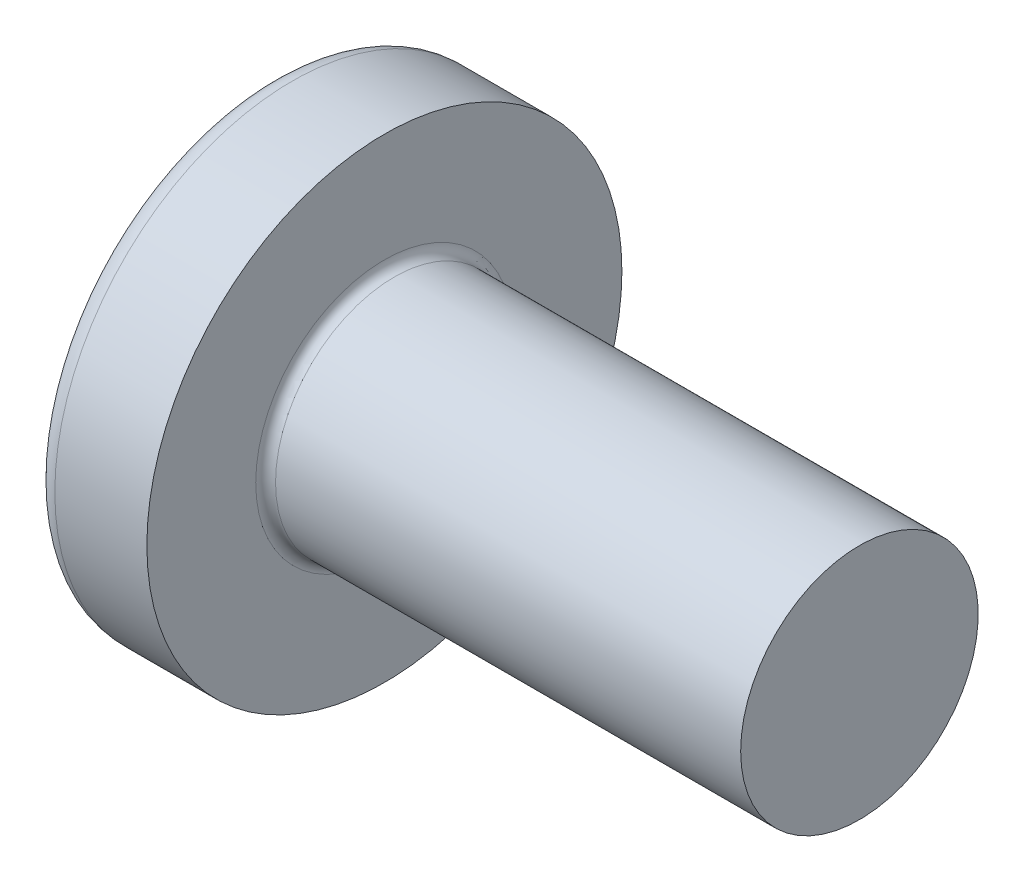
ISO-10303-21;
HEADER;
FILE_DESCRIPTION(('STEP AP214'),'2;1');
FILE_NAME('part.step','',(''),(''),'','','');
FILE_SCHEMA(('AUTOMOTIVE_DESIGN { 1 0 10303 214 1 1 1 1 }'));
ENDSEC;
DATA;
#1=APPLICATION_CONTEXT('core data for automotive mechanical design processes');
#2=APPLICATION_PROTOCOL_DEFINITION('international standard','automotive_design',2000,#1);
#3=PRODUCT_CONTEXT('',#1,'mechanical');
#4=PRODUCT('Part','Part','',(#3));
#5=PRODUCT_RELATED_PRODUCT_CATEGORY('part','',(#4));
#6=PRODUCT_DEFINITION_FORMATION('','',#4);
#7=PRODUCT_DEFINITION_CONTEXT('part definition',#1,'design');
#8=PRODUCT_DEFINITION('design','',#6,#7);
#9=PRODUCT_DEFINITION_SHAPE('','',#8);
#10=(LENGTH_UNIT() NAMED_UNIT(*) SI_UNIT(.MILLI.,.METRE.));
#11=(NAMED_UNIT(*) PLANE_ANGLE_UNIT() SI_UNIT($,.RADIAN.));
#12=(NAMED_UNIT(*) SI_UNIT($,.STERADIAN.) SOLID_ANGLE_UNIT());
#13=UNCERTAINTY_MEASURE_WITH_UNIT(LENGTH_MEASURE(1.E-05),#10,'distance_accuracy_value','');
#14=(GEOMETRIC_REPRESENTATION_CONTEXT(3) GLOBAL_UNCERTAINTY_ASSIGNED_CONTEXT((#13)) GLOBAL_UNIT_ASSIGNED_CONTEXT((#10,
#11,#12)) REPRESENTATION_CONTEXT('',''));
#15=CARTESIAN_POINT('',(0.,0.,0.));
#16=DIRECTION('',(0.,0.,1.));
#17=DIRECTION('',(1.,0.,0.));
#18=AXIS2_PLACEMENT_3D('',#15,#16,#17);
#19=CARTESIAN_POINT('',(10.,0.,0.));
#20=DIRECTION('',(-1.,0.,0.));
#21=DIRECTION('',(0.,1.,0.));
#22=AXIS2_PLACEMENT_3D('',#19,#20,#21);
#23=SPHERICAL_SURFACE('',#22,10.);
#24=CARTESIAN_POINT('',(1.83373872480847,0.,0.));
#25=DIRECTION('',(-1.,0.,0.));
#26=DIRECTION('',(0.,0.,1.));
#27=AXIS2_PLACEMENT_3D('',#24,#25,#26);
#28=CIRCLE('',#27,5.77167019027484);
#29=CARTESIAN_POINT('',(1.83373872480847,0.,5.77167019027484));
#30=VERTEX_POINT('',#29);
#31=EDGE_CURVE('E216',#30,#30,#28,.T.);
#32=ORIENTED_EDGE('',*,*,#31,.T.);
#33=EDGE_LOOP('',(#32));
#34=FACE_BOUND('',#33,.T.);
#35=CARTESIAN_POINT('',(0.11533271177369,0.,0.));
#36=DIRECTION('',(1.,0.,0.));
#37=DIRECTION('',(0.,0.,-1.));
#38=AXIS2_PLACEMENT_3D('',#35,#36,#37);
#39=CIRCLE('',#38,1.51438192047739);
#40=CARTESIAN_POINT('',(0.115332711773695,-0.709999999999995,-1.33762947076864));
#41=VERTEX_POINT('',#40);
#42=CARTESIAN_POINT('',(0.11533271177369,-1.33762947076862,-0.71));
#43=VERTEX_POINT('',#42);
#44=EDGE_CURVE('E343',#41,#43,#39,.F.);
#45=ORIENTED_EDGE('',*,*,#44,.F.);
#46=CARTESIAN_POINT('',(10.,-0.71,0.));
#47=DIRECTION('',(0.,1.,0.));
#48=DIRECTION('',(0.,0.,1.));
#49=AXIS2_PLACEMENT_3D('',#46,#47,#48);
#50=CIRCLE('',#49,9.97476315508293);
#51=CARTESIAN_POINT('',(0.516695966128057,-0.709999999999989,-3.09238493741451));
#52=VERTEX_POINT('',#51);
#53=EDGE_CURVE('E276',#52,#41,#50,.T.);
#54=ORIENTED_EDGE('',*,*,#53,.F.);
#55=CARTESIAN_POINT('',(9.3467899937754,0.,1.3101368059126));
#56=DIRECTION('',(0.446197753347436,0.,-0.894934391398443));
#57=DIRECTION('',(-0.894934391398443,0.,-0.446197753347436));
#58=AXIS2_PLACEMENT_3D('',#55,#56,#57);
#59=CIRCLE('',#58,9.89226254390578);
#60=CARTESIAN_POINT('',(0.516695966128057,0.710000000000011,-3.0923849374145));
#61=VERTEX_POINT('',#60);
#62=EDGE_CURVE('E250',#52,#61,#59,.T.);
#63=ORIENTED_EDGE('',*,*,#62,.T.);
#64=CARTESIAN_POINT('',(10.,0.71,0.));
#65=DIRECTION('',(0.,-1.,0.));
#66=DIRECTION('',(0.,0.,-1.));
#67=AXIS2_PLACEMENT_3D('',#64,#65,#66);
#68=CIRCLE('',#67,9.97476315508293);
#69=CARTESIAN_POINT('',(0.115332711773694,0.710000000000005,-1.33762947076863));
#70=VERTEX_POINT('',#69);
#71=EDGE_CURVE('E305',#70,#61,#68,.T.);
#72=ORIENTED_EDGE('',*,*,#71,.F.);
#73=CARTESIAN_POINT('',(0.11533271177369,1.33762947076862,-0.71));
#74=VERTEX_POINT('',#73);
#75=EDGE_CURVE('E358',#74,#70,#39,.F.);
#76=ORIENTED_EDGE('',*,*,#75,.F.);
#77=CARTESIAN_POINT('',(10.,0.,-0.71));
#78=DIRECTION('',(0.,0.,1.));
#79=DIRECTION('',(1.,0.,0.));
#80=AXIS2_PLACEMENT_3D('',#77,#78,#79);
#81=CIRCLE('',#80,9.97476315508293);
#82=CARTESIAN_POINT('',(0.516695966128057,3.09238493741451,-0.71));
#83=VERTEX_POINT('',#82);
#84=EDGE_CURVE('E244',#83,#74,#81,.T.);
#85=ORIENTED_EDGE('',*,*,#84,.F.);
#86=CARTESIAN_POINT('',(9.3467899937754,-1.3101368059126,0.));
#87=DIRECTION('',(0.446197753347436,0.894934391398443,0.));
#88=DIRECTION('',(-0.894934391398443,0.446197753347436,0.));
#89=AXIS2_PLACEMENT_3D('',#86,#87,#88);
#90=CIRCLE('',#89,9.89226254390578);
#91=CARTESIAN_POINT('',(0.516695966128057,3.09238493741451,0.71));
#92=VERTEX_POINT('',#91);
#93=EDGE_CURVE('E247',#83,#92,#90,.T.);
#94=ORIENTED_EDGE('',*,*,#93,.T.);
#95=CARTESIAN_POINT('',(10.,0.,0.71));
#96=DIRECTION('',(0.,0.,-1.));
#97=DIRECTION('',(0.,1.,0.));
#98=AXIS2_PLACEMENT_3D('',#95,#96,#97);
#99=CIRCLE('',#98,9.97476315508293);
#100=CARTESIAN_POINT('',(0.11533271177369,1.33762947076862,0.71));
#101=VERTEX_POINT('',#100);
#102=EDGE_CURVE('E240',#101,#92,#99,.T.);
#103=ORIENTED_EDGE('',*,*,#102,.F.);
#104=CARTESIAN_POINT('',(0.115332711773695,0.709999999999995,1.33762947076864));
#105=VERTEX_POINT('',#104);
#106=EDGE_CURVE('E357',#105,#101,#39,.F.);
#107=ORIENTED_EDGE('',*,*,#106,.F.);
#108=CARTESIAN_POINT('',(0.516695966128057,0.709999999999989,3.09238493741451));
#109=VERTEX_POINT('',#108);
#110=EDGE_CURVE('E260',#109,#105,#68,.T.);
#111=ORIENTED_EDGE('',*,*,#110,.F.);
#112=CARTESIAN_POINT('',(9.3467899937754,0.,-1.3101368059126));
#113=DIRECTION('',(0.446197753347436,0.,0.894934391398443));
#114=DIRECTION('',(0.894934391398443,0.,-0.446197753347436));
#115=AXIS2_PLACEMENT_3D('',#112,#113,#114);
#116=CIRCLE('',#115,9.89226254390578);
#117=CARTESIAN_POINT('',(0.516695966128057,-0.710000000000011,3.0923849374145));
#118=VERTEX_POINT('',#117);
#119=EDGE_CURVE('E51',#109,#118,#116,.T.);
#120=ORIENTED_EDGE('',*,*,#119,.T.);
#121=CARTESIAN_POINT('',(0.115332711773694,-0.710000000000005,1.33762947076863));
#122=VERTEX_POINT('',#121);
#123=EDGE_CURVE('E257',#122,#118,#50,.T.);
#124=ORIENTED_EDGE('',*,*,#123,.F.);
#125=CARTESIAN_POINT('',(0.11533271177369,-1.33762947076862,0.709999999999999));
#126=VERTEX_POINT('',#125);
#127=EDGE_CURVE('E393',#126,#122,#39,.F.);
#128=ORIENTED_EDGE('',*,*,#127,.F.);
#129=CARTESIAN_POINT('',(0.516695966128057,-3.0923849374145,0.709999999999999));
#130=VERTEX_POINT('',#129);
#131=EDGE_CURVE('E241',#130,#126,#99,.T.);
#132=ORIENTED_EDGE('',*,*,#131,.F.);
#133=CARTESIAN_POINT('',(9.3467899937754,1.3101368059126,0.));
#134=DIRECTION('',(0.446197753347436,-0.894934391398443,0.));
#135=DIRECTION('',(0.894934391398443,0.446197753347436,0.));
#136=AXIS2_PLACEMENT_3D('',#133,#134,#135);
#137=CIRCLE('',#136,9.89226254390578);
#138=CARTESIAN_POINT('',(0.516695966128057,-3.09238493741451,-0.71));
#139=VERTEX_POINT('',#138);
#140=EDGE_CURVE('E237',#130,#139,#137,.T.);
#141=ORIENTED_EDGE('',*,*,#140,.T.);
#142=EDGE_CURVE('E66',#43,#139,#81,.T.);
#143=ORIENTED_EDGE('',*,*,#142,.F.);
#144=EDGE_LOOP('',(#45,#54,#63,#72,#76,#85,#94,#103,#107,#111,#120,#124,#128,#132,#141,#143));
#145=FACE_BOUND('',#144,.T.);
#146=ADVANCED_FACE('F37',(#34,#145),#23,.T.);
#147=CARTESIAN_POINT('',(3.46,1.62490792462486,-0.71));
#148=DIRECTION('',(0.,0.,1.));
#149=DIRECTION('',(1.,0.,0.));
#150=AXIS2_PLACEMENT_3D('',#147,#148,#149);
#151=PLANE('',#150);
#152=ORIENTED_EDGE('',*,*,#84,.T.);
#153=CARTESIAN_POINT('',(-2.28089704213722,1.52473965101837,-0.71));
#154=CARTESIAN_POINT('',(-1.81861622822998,1.48907386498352,-0.71));
#155=CARTESIAN_POINT('',(-1.35635131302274,1.45320000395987,-0.71));
#156=CARTESIAN_POINT('',(-0.431857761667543,1.3808964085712,-0.71));
#157=CARTESIAN_POINT('',(0.0303708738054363,1.34446666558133,-0.71));
#158=CARTESIAN_POINT('',(0.954772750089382,1.27091270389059,-0.71));
#159=CARTESIAN_POINT('',(1.41694599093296,1.23378848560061,-0.71));
#160=CARTESIAN_POINT('',(2.1101468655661,1.17741958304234,-0.71));
#161=CARTESIAN_POINT('',(2.34120225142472,1.15851633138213,-0.71));
#162=CARTESIAN_POINT('',(2.80329254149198,1.12044387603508,-0.71));
#163=CARTESIAN_POINT('',(3.03432744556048,1.10127467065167,-0.71));
#164=CARTESIAN_POINT('',(3.81376951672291,1.03608826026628,-0.71));
#165=CARTESIAN_POINT('',(4.3621185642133,0.989367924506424,-0.71));
#166=CARTESIAN_POINT('',(5.18446393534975,0.917336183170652,-0.71));
#167=CARTESIAN_POINT('',(5.45854573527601,0.893000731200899,-0.71));
#168=CARTESIAN_POINT('',(6.00663594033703,0.843493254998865,-0.71));
#169=CARTESIAN_POINT('',(6.28064434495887,0.818321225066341,-0.71));
#170=CARTESIAN_POINT('',(6.82859287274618,0.766879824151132,-0.71));
#171=CARTESIAN_POINT('',(7.10253298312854,0.740610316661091,-0.71));
#172=CARTESIAN_POINT('',(7.65026285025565,0.686585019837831,-0.71));
#173=CARTESIAN_POINT('',(7.92405260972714,0.658829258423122,-0.71));
#174=CARTESIAN_POINT('',(8.33458184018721,0.615573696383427,-0.71));
#175=CARTESIAN_POINT('',(8.4714065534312,0.600884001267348,-0.71));
#176=CARTESIAN_POINT('',(8.74498055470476,0.570826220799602,-0.71));
#177=CARTESIAN_POINT('',(8.88172984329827,0.555458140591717,-0.71));
#178=CARTESIAN_POINT('',(9.15513948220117,0.523868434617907,-0.71));
#179=CARTESIAN_POINT('',(9.29179982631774,0.507646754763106,-0.71));
#180=CARTESIAN_POINT('',(9.56498051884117,0.474039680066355,-0.71));
#181=CARTESIAN_POINT('',(9.70150086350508,0.45665425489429,-0.71));
#182=CARTESIAN_POINT('',(9.83792645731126,0.438531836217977,-0.71));
#183=B_SPLINE_CURVE_WITH_KNOTS('',3,(#153,#154,#155,#156,#157,#158,#159,#160,#161,#162,#163,
#164,#165,#166,#167,#168,#169,#170,#171,#172,#173,#174,#175,#176,#177,#178,#179,#180,#181,#182),
.UNSPECIFIED.,.F.,.F.,(4,2,2,2,2,2,2,2,2,2,2,2,2,2,4),(0.,1.39096401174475,2.78194962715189,
4.17293441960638,4.86841633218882,5.56390268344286,7.21490482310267,8.04038405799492,
8.86586891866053,9.69145676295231,10.5170291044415,10.9298607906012,11.3426893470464,
11.7555440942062,12.1684096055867),.UNSPECIFIED.);
#184=CARTESIAN_POINT('',(3.46,1.06563607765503,-0.710000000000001));
#185=VERTEX_POINT('',#184);
#186=EDGE_CURVE('E380',#74,#185,#183,.T.);
#187=ORIENTED_EDGE('',*,*,#186,.T.);
#188=DIRECTION('',(0.,1.,0.));
#189=VECTOR('',#188,1.);
#190=CARTESIAN_POINT('',(3.46,-1.62490792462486,-0.71));
#191=LINE('',#190,#189);
#192=CARTESIAN_POINT('',(3.46,1.62490792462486,-0.71));
#193=VERTEX_POINT('',#192);
#194=EDGE_CURVE('E326',#185,#193,#191,.T.);
#195=ORIENTED_EDGE('',*,*,#194,.T.);
#196=DIRECTION('',(0.894934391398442,-0.446197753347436,0.));
#197=VECTOR('',#196,1.);
#198=CARTESIAN_POINT('',(0.,3.35,-0.71));
#199=LINE('',#198,#197);
#200=EDGE_CURVE('E217',#83,#193,#199,.T.);
#201=ORIENTED_EDGE('',*,*,#200,.F.);
#202=EDGE_LOOP('',(#152,#187,#195,#201));
#203=FACE_BOUND('',#202,.T.);
#204=ADVANCED_FACE('F172',(#203),#151,.T.);
#205=CARTESIAN_POINT('',(3.46,-1.62490792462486,-0.71));
#206=VERTEX_POINT('',#205);
#207=CARTESIAN_POINT('',(3.46,-1.06563607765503,-0.710000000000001));
#208=VERTEX_POINT('',#207);
#209=EDGE_CURVE('E225',#206,#208,#191,.T.);
#210=ORIENTED_EDGE('',*,*,#209,.T.);
#211=CARTESIAN_POINT('',(-2.28089704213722,-1.52473965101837,-0.71));
#212=CARTESIAN_POINT('',(-1.81861622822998,-1.48907386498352,-0.71));
#213=CARTESIAN_POINT('',(-1.35635131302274,-1.45320000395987,-0.71));
#214=CARTESIAN_POINT('',(-0.431857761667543,-1.3808964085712,-0.71));
#215=CARTESIAN_POINT('',(0.0303708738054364,-1.34446666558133,-0.71));
#216=CARTESIAN_POINT('',(0.954772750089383,-1.27091270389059,-0.71));
#217=CARTESIAN_POINT('',(1.41694599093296,-1.23378848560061,-0.71));
#218=CARTESIAN_POINT('',(2.1101468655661,-1.17741958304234,-0.71));
#219=CARTESIAN_POINT('',(2.34120225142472,-1.15851633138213,-0.71));
#220=CARTESIAN_POINT('',(2.80329254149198,-1.12044387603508,-0.71));
#221=CARTESIAN_POINT('',(3.03432744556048,-1.10127467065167,-0.71));
#222=CARTESIAN_POINT('',(3.81376951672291,-1.03608826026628,-0.71));
#223=CARTESIAN_POINT('',(4.3621185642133,-0.989367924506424,-0.71));
#224=CARTESIAN_POINT('',(5.18446393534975,-0.917336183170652,-0.71));
#225=CARTESIAN_POINT('',(5.45854573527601,-0.893000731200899,-0.71));
#226=CARTESIAN_POINT('',(6.00663594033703,-0.843493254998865,-0.71));
#227=CARTESIAN_POINT('',(6.28064434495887,-0.818321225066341,-0.71));
#228=CARTESIAN_POINT('',(6.82859287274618,-0.766879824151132,-0.71));
#229=CARTESIAN_POINT('',(7.10253298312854,-0.740610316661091,-0.71));
#230=CARTESIAN_POINT('',(7.65026285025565,-0.686585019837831,-0.71));
#231=CARTESIAN_POINT('',(7.92405260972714,-0.658829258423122,-0.71));
#232=CARTESIAN_POINT('',(8.33458184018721,-0.615573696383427,-0.71));
#233=CARTESIAN_POINT('',(8.4714065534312,-0.600884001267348,-0.71));
#234=CARTESIAN_POINT('',(8.74498055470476,-0.570826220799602,-0.71));
#235=CARTESIAN_POINT('',(8.88172984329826,-0.555458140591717,-0.71));
#236=CARTESIAN_POINT('',(9.15513948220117,-0.523868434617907,-0.71));
#237=CARTESIAN_POINT('',(9.29179982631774,-0.507646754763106,-0.71));
#238=CARTESIAN_POINT('',(9.56498051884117,-0.474039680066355,-0.71));
#239=CARTESIAN_POINT('',(9.70150086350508,-0.456654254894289,-0.71));
#240=CARTESIAN_POINT('',(9.83792645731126,-0.438531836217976,-0.71));
#241=B_SPLINE_CURVE_WITH_KNOTS('',3,(#211,#212,#213,#214,#215,#216,#217,#218,#219,#220,#221,
#222,#223,#224,#225,#226,#227,#228,#229,#230,#231,#232,#233,#234,#235,#236,#237,#238,#239,#240),
.UNSPECIFIED.,.F.,.F.,(4,2,2,2,2,2,2,2,2,2,2,2,2,2,4),(0.,1.39096401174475,2.78194962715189,
4.17293441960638,4.86841633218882,5.56390268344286,7.21490482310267,8.04038405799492,
8.86586891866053,9.69145676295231,10.5170291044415,10.9298607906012,11.3426893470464,
11.7555440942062,12.1684096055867),.UNSPECIFIED.);
#242=EDGE_CURVE('E356',#208,#43,#241,.F.);
#243=ORIENTED_EDGE('',*,*,#242,.T.);
#244=ORIENTED_EDGE('',*,*,#142,.T.);
#245=DIRECTION('',(0.894934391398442,0.446197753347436,0.));
#246=VECTOR('',#245,1.);
#247=CARTESIAN_POINT('',(0.,-3.35,-0.71));
#248=LINE('',#247,#246);
#249=EDGE_CURVE('E308',#139,#206,#248,.T.);
#250=ORIENTED_EDGE('',*,*,#249,.T.);
#251=EDGE_LOOP('',(#210,#243,#244,#250));
#252=FACE_BOUND('',#251,.T.);
#253=ADVANCED_FACE('F178',(#252),#151,.T.);
#254=CARTESIAN_POINT('',(3.46,-1.62490792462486,0.71));
#255=DIRECTION('',(0.,0.,-1.));
#256=DIRECTION('',(0.,1.,0.));
#257=AXIS2_PLACEMENT_3D('',#254,#255,#256);
#258=PLANE('',#257);
#259=DIRECTION('',(0.,-1.,0.));
#260=VECTOR('',#259,1.);
#261=CARTESIAN_POINT('',(3.46,1.62490792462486,0.71));
#262=LINE('',#261,#260);
#263=CARTESIAN_POINT('',(3.46,1.62490792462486,0.71));
#264=VERTEX_POINT('',#263);
#265=CARTESIAN_POINT('',(3.46,1.06563607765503,0.710000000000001));
#266=VERTEX_POINT('',#265);
#267=EDGE_CURVE('E316',#264,#266,#262,.T.);
#268=ORIENTED_EDGE('',*,*,#267,.T.);
#269=CARTESIAN_POINT('',(-2.28089705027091,1.52473965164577,0.71));
#270=CARTESIAN_POINT('',(-1.81861623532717,1.48907386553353,0.71));
#271=CARTESIAN_POINT('',(-1.35635131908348,1.45320000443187,0.71));
#272=CARTESIAN_POINT('',(-0.431857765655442,1.38089640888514,0.71));
#273=CARTESIAN_POINT('',(0.0303708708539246,1.3444666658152,0.71));
#274=CARTESIAN_POINT('',(0.954772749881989,1.27091270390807,0.71));
#275=CARTESIAN_POINT('',(1.41694599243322,1.23378848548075,0.71));
#276=CARTESIAN_POINT('',(2.11014686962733,1.17741958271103,0.71));
#277=CARTESIAN_POINT('',(2.3412022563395,1.15851633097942,0.71));
#278=CARTESIAN_POINT('',(2.80329254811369,1.12044387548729,0.71));
#279=CARTESIAN_POINT('',(3.03432745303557,1.10127467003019,0.71));
#280=CARTESIAN_POINT('',(3.8137695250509,1.03608825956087,0.71));
#281=CARTESIAN_POINT('',(4.36211857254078,0.989367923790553,0.71));
#282=CARTESIAN_POINT('',(5.18446394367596,0.917336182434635,0.71));
#283=CARTESIAN_POINT('',(5.45854574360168,0.893000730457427,0.71));
#284=CARTESIAN_POINT('',(6.00663594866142,0.843493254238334,0.71));
#285=CARTESIAN_POINT('',(6.28064435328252,0.818321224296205,0.71));
#286=CARTESIAN_POINT('',(6.82859288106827,0.766879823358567,0.71));
#287=CARTESIAN_POINT('',(7.1025329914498,0.7406103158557,0.71));
#288=CARTESIAN_POINT('',(7.65026285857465,0.686585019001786,0.71));
#289=CARTESIAN_POINT('',(7.92405261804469,0.658829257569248,0.71));
#290=CARTESIAN_POINT('',(8.3345818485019,0.61557369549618,0.71));
#291=CARTESIAN_POINT('',(8.47140656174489,0.600884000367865,0.71));
#292=CARTESIAN_POINT('',(8.74498056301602,0.570826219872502,0.71));
#293=CARTESIAN_POINT('',(8.8817298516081,0.555458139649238,0.71));
#294=CARTESIAN_POINT('',(9.15513949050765,0.523868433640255,0.71));
#295=CARTESIAN_POINT('',(9.29179983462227,0.50764675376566,0.71));
#296=CARTESIAN_POINT('',(9.56498052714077,0.474039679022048,0.71));
#297=CARTESIAN_POINT('',(9.70150087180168,0.456654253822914,0.71));
#298=CARTESIAN_POINT('',(9.83792646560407,0.438531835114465,0.71));
#299=B_SPLINE_CURVE_WITH_KNOTS('',3,(#269,#270,#271,#272,#273,#274,#275,#276,#277,#278,#279,
#280,#281,#282,#283,#284,#285,#286,#287,#288,#289,#290,#291,#292,#293,#294,#295,#296,#297,#298),
.UNSPECIFIED.,.F.,.F.,(4,2,2,2,2,2,2,2,2,2,2,2,2,2,4),(0.,1.39096401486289,2.78194963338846,
4.17293443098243,4.86841634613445,5.56390269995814,7.21490483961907,8.04038407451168,
8.86586893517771,9.69145677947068,10.5170291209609,10.9298608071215,11.3426893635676,
11.7555441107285,12.1684096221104),.UNSPECIFIED.);
#300=EDGE_CURVE('E281',#266,#101,#299,.F.);
#301=ORIENTED_EDGE('',*,*,#300,.T.);
#302=ORIENTED_EDGE('',*,*,#102,.T.);
#303=DIRECTION('',(0.894934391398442,-0.446197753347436,0.));
#304=VECTOR('',#303,1.);
#305=CARTESIAN_POINT('',(0.,3.35,0.71));
#306=LINE('',#305,#304);
#307=EDGE_CURVE('E222',#92,#264,#306,.T.);
#308=ORIENTED_EDGE('',*,*,#307,.T.);
#309=EDGE_LOOP('',(#268,#301,#302,#308));
#310=FACE_BOUND('',#309,.T.);
#311=ADVANCED_FACE('F376',(#310),#258,.T.);
#312=ORIENTED_EDGE('',*,*,#131,.T.);
#313=CARTESIAN_POINT('',(-2.28089704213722,-1.52473965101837,0.71));
#314=CARTESIAN_POINT('',(-1.81861622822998,-1.48907386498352,0.71));
#315=CARTESIAN_POINT('',(-1.35635131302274,-1.45320000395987,0.71));
#316=CARTESIAN_POINT('',(-0.431857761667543,-1.3808964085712,0.71));
#317=CARTESIAN_POINT('',(0.0303708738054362,-1.34446666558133,0.71));
#318=CARTESIAN_POINT('',(0.954772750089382,-1.27091270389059,0.71));
#319=CARTESIAN_POINT('',(1.41694599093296,-1.23378848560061,0.71));
#320=CARTESIAN_POINT('',(2.1101468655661,-1.17741958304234,0.71));
#321=CARTESIAN_POINT('',(2.34120225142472,-1.15851633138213,0.71));
#322=CARTESIAN_POINT('',(2.80329254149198,-1.12044387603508,0.71));
#323=CARTESIAN_POINT('',(3.03432744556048,-1.10127467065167,0.71));
#324=CARTESIAN_POINT('',(3.81376951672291,-1.03608826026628,0.71));
#325=CARTESIAN_POINT('',(4.3621185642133,-0.989367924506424,0.71));
#326=CARTESIAN_POINT('',(5.18446393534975,-0.917336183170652,0.71));
#327=CARTESIAN_POINT('',(5.45854573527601,-0.893000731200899,0.71));
#328=CARTESIAN_POINT('',(6.00663594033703,-0.843493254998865,0.71));
#329=CARTESIAN_POINT('',(6.28064434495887,-0.818321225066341,0.71));
#330=CARTESIAN_POINT('',(6.82859287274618,-0.766879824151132,0.71));
#331=CARTESIAN_POINT('',(7.10253298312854,-0.740610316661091,0.71));
#332=CARTESIAN_POINT('',(7.65026285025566,-0.686585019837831,0.71));
#333=CARTESIAN_POINT('',(7.92405260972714,-0.658829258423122,0.71));
#334=CARTESIAN_POINT('',(8.33458184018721,-0.615573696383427,0.71));
#335=CARTESIAN_POINT('',(8.4714065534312,-0.600884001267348,0.71));
#336=CARTESIAN_POINT('',(8.74498055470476,-0.570826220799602,0.71));
#337=CARTESIAN_POINT('',(8.88172984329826,-0.555458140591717,0.71));
#338=CARTESIAN_POINT('',(9.15513948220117,-0.523868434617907,0.71));
#339=CARTESIAN_POINT('',(9.29179982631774,-0.507646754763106,0.71));
#340=CARTESIAN_POINT('',(9.56498051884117,-0.474039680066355,0.71));
#341=CARTESIAN_POINT('',(9.70150086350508,-0.456654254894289,0.71));
#342=CARTESIAN_POINT('',(9.83792645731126,-0.438531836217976,0.71));
#343=B_SPLINE_CURVE_WITH_KNOTS('',3,(#313,#314,#315,#316,#317,#318,#319,#320,#321,#322,#323,
#324,#325,#326,#327,#328,#329,#330,#331,#332,#333,#334,#335,#336,#337,#338,#339,#340,#341,#342),
.UNSPECIFIED.,.F.,.F.,(4,2,2,2,2,2,2,2,2,2,2,2,2,2,4),(0.,1.39096401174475,2.78194962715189,
4.17293441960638,4.86841633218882,5.56390268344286,7.21490482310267,8.04038405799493,
8.86586891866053,9.69145676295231,10.5170291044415,10.9298607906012,11.3426893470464,
11.7555440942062,12.1684096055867),.UNSPECIFIED.);
#344=CARTESIAN_POINT('',(3.46,-1.06563607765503,0.710000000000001));
#345=VERTEX_POINT('',#344);
#346=EDGE_CURVE('E394',#126,#345,#343,.T.);
#347=ORIENTED_EDGE('',*,*,#346,.T.);
#348=CARTESIAN_POINT('',(3.46,-1.62490792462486,0.71));
#349=VERTEX_POINT('',#348);
#350=EDGE_CURVE('E318',#345,#349,#262,.T.);
#351=ORIENTED_EDGE('',*,*,#350,.T.);
#352=DIRECTION('',(0.894934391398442,0.446197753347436,0.));
#353=VECTOR('',#352,1.);
#354=CARTESIAN_POINT('',(0.,-3.35,0.709999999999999));
#355=LINE('',#354,#353);
#356=EDGE_CURVE('E310',#130,#349,#355,.T.);
#357=ORIENTED_EDGE('',*,*,#356,.F.);
#358=EDGE_LOOP('',(#312,#347,#351,#357));
#359=FACE_BOUND('',#358,.T.);
#360=ADVANCED_FACE('F424',(#359),#258,.T.);
#361=CARTESIAN_POINT('',(3.46,1.62490792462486,-0.709999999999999));
#362=DIRECTION('',(-1.,0.,0.));
#363=DIRECTION('',(0.,0.,1.));
#364=AXIS2_PLACEMENT_3D('',#361,#362,#363);
#365=PLANE('',#364);
#366=ORIENTED_EDGE('',*,*,#350,.F.);
#367=CARTESIAN_POINT('',(3.46,0.,0.));
#368=DIRECTION('',(-1.,0.,0.));
#369=DIRECTION('',(0.,0.,1.));
#370=AXIS2_PLACEMENT_3D('',#367,#368,#369);
#371=CIRCLE('',#370,1.2805);
#372=EDGE_CURVE('E351',#208,#345,#371,.T.);
#373=ORIENTED_EDGE('',*,*,#372,.F.);
#374=ORIENTED_EDGE('',*,*,#209,.F.);
#375=DIRECTION('',(0.,0.,1.));
#376=VECTOR('',#375,1.);
#377=CARTESIAN_POINT('',(3.46,-1.62490792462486,-0.71));
#378=LINE('',#377,#376);
#379=EDGE_CURVE('E313',#206,#349,#378,.T.);
#380=ORIENTED_EDGE('',*,*,#379,.T.);
#381=EDGE_LOOP('',(#366,#373,#374,#380));
#382=FACE_BOUND('',#381,.T.);
#383=ADVANCED_FACE('F417',(#382),#365,.T.);
#384=DIRECTION('',(0.,0.,-1.));
#385=VECTOR('',#384,1.);
#386=CARTESIAN_POINT('',(3.46,-0.710000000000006,1.62490792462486));
#387=LINE('',#386,#385);
#388=CARTESIAN_POINT('',(3.46,-0.709999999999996,-1.06563607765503));
#389=VERTEX_POINT('',#388);
#390=CARTESIAN_POINT('',(3.46,-0.709999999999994,-1.62490792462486));
#391=VERTEX_POINT('',#390);
#392=EDGE_CURVE('E299',#389,#391,#387,.T.);
#393=ORIENTED_EDGE('',*,*,#392,.F.);
#394=CARTESIAN_POINT('',(3.46,0.710000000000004,-1.06563607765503));
#395=VERTEX_POINT('',#394);
#396=EDGE_CURVE('E58',#395,#389,#371,.T.);
#397=ORIENTED_EDGE('',*,*,#396,.F.);
#398=DIRECTION('',(0.,0.,1.));
#399=VECTOR('',#398,1.);
#400=CARTESIAN_POINT('',(3.46,0.710000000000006,-1.62490792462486));
#401=LINE('',#400,#399);
#402=CARTESIAN_POINT('',(3.46,0.710000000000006,-1.62490792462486));
#403=VERTEX_POINT('',#402);
#404=EDGE_CURVE('E302',#403,#395,#401,.T.);
#405=ORIENTED_EDGE('',*,*,#404,.F.);
#406=DIRECTION('',(0.,-1.,0.));
#407=VECTOR('',#406,1.);
#408=CARTESIAN_POINT('',(3.46,0.710000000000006,-1.62490792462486));
#409=LINE('',#408,#407);
#410=EDGE_CURVE('E293',#403,#391,#409,.T.);
#411=ORIENTED_EDGE('',*,*,#410,.T.);
#412=EDGE_LOOP('',(#393,#397,#405,#411));
#413=FACE_BOUND('',#412,.T.);
#414=ADVANCED_FACE('F346',(#413),#365,.T.);
#415=ORIENTED_EDGE('',*,*,#194,.F.);
#416=EDGE_CURVE('E350',#266,#185,#371,.T.);
#417=ORIENTED_EDGE('',*,*,#416,.F.);
#418=ORIENTED_EDGE('',*,*,#267,.F.);
#419=DIRECTION('',(0.,0.,-1.));
#420=VECTOR('',#419,1.);
#421=CARTESIAN_POINT('',(3.46,1.62490792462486,0.71));
#422=LINE('',#421,#420);
#423=EDGE_CURVE('E319',#264,#193,#422,.T.);
#424=ORIENTED_EDGE('',*,*,#423,.T.);
#425=EDGE_LOOP('',(#415,#417,#418,#424));
#426=FACE_BOUND('',#425,.T.);
#427=ADVANCED_FACE('F418',(#426),#365,.T.);
#428=CARTESIAN_POINT('',(3.46,0.709999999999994,1.62490792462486));
#429=DIRECTION('',(0.,-1.,0.));
#430=DIRECTION('',(1.,0.,0.));
#431=AXIS2_PLACEMENT_3D('',#428,#429,#430);
#432=PLANE('',#431);
#433=ORIENTED_EDGE('',*,*,#110,.T.);
#434=CARTESIAN_POINT('',(-2.28089704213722,0.709999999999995,1.52473965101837));
#435=CARTESIAN_POINT('',(-1.81861622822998,0.709999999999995,1.48907386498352));
#436=CARTESIAN_POINT('',(-1.35635131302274,0.709999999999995,1.45320000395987));
#437=CARTESIAN_POINT('',(-0.431857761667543,0.709999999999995,1.38089640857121));
#438=CARTESIAN_POINT('',(0.0303708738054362,0.709999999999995,1.34446666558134));
#439=CARTESIAN_POINT('',(0.954772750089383,0.709999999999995,1.2709127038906));
#440=CARTESIAN_POINT('',(1.41694599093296,0.709999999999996,1.23378848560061));
#441=CARTESIAN_POINT('',(2.1101468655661,0.709999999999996,1.17741958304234));
#442=CARTESIAN_POINT('',(2.34120225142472,0.709999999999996,1.15851633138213));
#443=CARTESIAN_POINT('',(2.80329254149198,0.709999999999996,1.12044387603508));
#444=CARTESIAN_POINT('',(3.03432744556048,0.709999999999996,1.10127467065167));
#445=CARTESIAN_POINT('',(3.81376951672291,0.709999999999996,1.03608826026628));
#446=CARTESIAN_POINT('',(4.3621185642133,0.709999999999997,0.989367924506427));
#447=CARTESIAN_POINT('',(5.18446393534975,0.709999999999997,0.917336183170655));
#448=CARTESIAN_POINT('',(5.45854573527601,0.709999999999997,0.893000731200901));
#449=CARTESIAN_POINT('',(6.00663594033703,0.709999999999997,0.843493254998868));
#450=CARTESIAN_POINT('',(6.28064434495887,0.709999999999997,0.818321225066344));
#451=CARTESIAN_POINT('',(6.82859287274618,0.709999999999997,0.766879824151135));
#452=CARTESIAN_POINT('',(7.10253298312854,0.709999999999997,0.740610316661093));
#453=CARTESIAN_POINT('',(7.65026285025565,0.709999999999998,0.686585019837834));
#454=CARTESIAN_POINT('',(7.92405260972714,0.709999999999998,0.658829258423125));
#455=CARTESIAN_POINT('',(8.33458184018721,0.709999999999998,0.615573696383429));
#456=CARTESIAN_POINT('',(8.4714065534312,0.709999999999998,0.600884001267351));
#457=CARTESIAN_POINT('',(8.74498055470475,0.709999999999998,0.570826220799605));
#458=CARTESIAN_POINT('',(8.88172984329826,0.709999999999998,0.55545814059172));
#459=CARTESIAN_POINT('',(9.15513948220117,0.709999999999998,0.52386843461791));
#460=CARTESIAN_POINT('',(9.29179982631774,0.709999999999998,0.507646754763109));
#461=CARTESIAN_POINT('',(9.56498051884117,0.709999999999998,0.474039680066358));
#462=CARTESIAN_POINT('',(9.70150086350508,0.709999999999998,0.456654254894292));
#463=CARTESIAN_POINT('',(9.83792645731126,0.709999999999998,0.438531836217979));
#464=B_SPLINE_CURVE_WITH_KNOTS('',3,(#434,#435,#436,#437,#438,#439,#440,#441,#442,#443,#444,
#445,#446,#447,#448,#449,#450,#451,#452,#453,#454,#455,#456,#457,#458,#459,#460,#461,#462,#463),
.UNSPECIFIED.,.F.,.F.,(4,2,2,2,2,2,2,2,2,2,2,2,2,2,4),(0.,1.39096401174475,2.78194962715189,
4.17293441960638,4.86841633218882,5.56390268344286,7.21490482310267,8.04038405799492,
8.86586891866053,9.6914567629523,10.5170291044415,10.9298607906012,11.3426893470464,
11.7555440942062,12.1684096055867),.UNSPECIFIED.);
#465=CARTESIAN_POINT('',(3.46,0.709999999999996,1.06563607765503));
#466=VERTEX_POINT('',#465);
#467=EDGE_CURVE('E442',#105,#466,#464,.T.);
#468=ORIENTED_EDGE('',*,*,#467,.T.);
#469=CARTESIAN_POINT('',(3.46,0.709999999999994,1.62490792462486));
#470=VERTEX_POINT('',#469);
#471=EDGE_CURVE('E274',#466,#470,#401,.T.);
#472=ORIENTED_EDGE('',*,*,#471,.T.);
#473=DIRECTION('',(0.894934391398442,0.,-0.446197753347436));
#474=VECTOR('',#473,1.);
#475=CARTESIAN_POINT('',(0.,0.709999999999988,3.35));
#476=LINE('',#475,#474);
#477=EDGE_CURVE('E267',#109,#470,#476,.T.);
#478=ORIENTED_EDGE('',*,*,#477,.F.);
#479=EDGE_LOOP('',(#433,#468,#472,#478));
#480=FACE_BOUND('',#479,.T.);
#481=ADVANCED_FACE('F271',(#480),#432,.T.);
#482=CARTESIAN_POINT('',(3.46,-0.709999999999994,-1.62490792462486));
#483=DIRECTION('',(0.,1.,0.));
#484=DIRECTION('',(0.,0.,1.));
#485=AXIS2_PLACEMENT_3D('',#482,#483,#484);
#486=PLANE('',#485);
#487=CARTESIAN_POINT('',(3.46,-0.710000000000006,1.62490792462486));
#488=VERTEX_POINT('',#487);
#489=CARTESIAN_POINT('',(3.46,-0.710000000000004,1.06563607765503));
#490=VERTEX_POINT('',#489);
#491=EDGE_CURVE('E296',#488,#490,#387,.T.);
#492=ORIENTED_EDGE('',*,*,#491,.T.);
#493=CARTESIAN_POINT('',(-2.28089705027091,-0.710000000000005,1.52473965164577));
#494=CARTESIAN_POINT('',(-1.81861623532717,-0.710000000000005,1.48907386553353));
#495=CARTESIAN_POINT('',(-1.35635131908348,-0.710000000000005,1.45320000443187));
#496=CARTESIAN_POINT('',(-0.431857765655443,-0.710000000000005,1.38089640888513));
#497=CARTESIAN_POINT('',(0.030370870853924,-0.710000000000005,1.3444666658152));
#498=CARTESIAN_POINT('',(0.954772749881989,-0.710000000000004,1.27091270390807));
#499=CARTESIAN_POINT('',(1.41694599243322,-0.710000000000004,1.23378848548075));
#500=CARTESIAN_POINT('',(2.11014686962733,-0.710000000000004,1.17741958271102));
#501=CARTESIAN_POINT('',(2.3412022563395,-0.710000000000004,1.15851633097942));
#502=CARTESIAN_POINT('',(2.80329254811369,-0.710000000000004,1.12044387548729));
#503=CARTESIAN_POINT('',(3.03432745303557,-0.710000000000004,1.10127467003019));
#504=CARTESIAN_POINT('',(3.81376952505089,-0.710000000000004,1.03608825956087));
#505=CARTESIAN_POINT('',(4.36211857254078,-0.710000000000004,0.989367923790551));
#506=CARTESIAN_POINT('',(5.18446394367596,-0.710000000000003,0.917336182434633));
#507=CARTESIAN_POINT('',(5.45854574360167,-0.710000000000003,0.893000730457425));
#508=CARTESIAN_POINT('',(6.00663594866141,-0.710000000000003,0.843493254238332));
#509=CARTESIAN_POINT('',(6.28064435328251,-0.710000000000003,0.818321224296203));
#510=CARTESIAN_POINT('',(6.82859288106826,-0.710000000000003,0.766879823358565));
#511=CARTESIAN_POINT('',(7.1025329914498,-0.710000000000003,0.740610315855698));
#512=CARTESIAN_POINT('',(7.65026285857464,-0.710000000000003,0.686585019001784));
#513=CARTESIAN_POINT('',(7.92405261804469,-0.710000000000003,0.658829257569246));
#514=CARTESIAN_POINT('',(8.33458184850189,-0.710000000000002,0.615573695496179));
#515=CARTESIAN_POINT('',(8.47140656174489,-0.710000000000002,0.600884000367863));
#516=CARTESIAN_POINT('',(8.74498056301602,-0.710000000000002,0.5708262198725));
#517=CARTESIAN_POINT('',(8.8817298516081,-0.710000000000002,0.555458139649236));
#518=CARTESIAN_POINT('',(9.15513949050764,-0.710000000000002,0.523868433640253));
#519=CARTESIAN_POINT('',(9.29179983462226,-0.710000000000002,0.507646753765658));
#520=CARTESIAN_POINT('',(9.56498052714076,-0.710000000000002,0.474039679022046));
#521=CARTESIAN_POINT('',(9.70150087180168,-0.710000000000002,0.456654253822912));
#522=CARTESIAN_POINT('',(9.83792646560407,-0.710000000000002,0.438531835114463));
#523=B_SPLINE_CURVE_WITH_KNOTS('',3,(#493,#494,#495,#496,#497,#498,#499,#500,#501,#502,#503,
#504,#505,#506,#507,#508,#509,#510,#511,#512,#513,#514,#515,#516,#517,#518,#519,#520,#521,#522),
.UNSPECIFIED.,.F.,.F.,(4,2,2,2,2,2,2,2,2,2,2,2,2,2,4),(0.,1.39096401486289,2.78194963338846,
4.17293443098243,4.86841634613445,5.56390269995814,7.21490483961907,8.04038407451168,
8.8658689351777,9.69145677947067,10.5170291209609,10.9298608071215,11.3426893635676,
11.7555441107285,12.1684096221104),.UNSPECIFIED.);
#524=EDGE_CURVE('E386',#490,#122,#523,.F.);
#525=ORIENTED_EDGE('',*,*,#524,.T.);
#526=ORIENTED_EDGE('',*,*,#123,.T.);
#527=DIRECTION('',(0.894934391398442,0.,-0.446197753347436));
#528=VECTOR('',#527,1.);
#529=CARTESIAN_POINT('',(0.,-0.710000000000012,3.35));
#530=LINE('',#529,#528);
#531=EDGE_CURVE('E269',#118,#488,#530,.T.);
#532=ORIENTED_EDGE('',*,*,#531,.T.);
#533=EDGE_LOOP('',(#492,#525,#526,#532));
#534=FACE_BOUND('',#533,.T.);
#535=ADVANCED_FACE('F207',(#534),#486,.T.);
#536=ORIENTED_EDGE('',*,*,#404,.T.);
#537=CARTESIAN_POINT('',(-2.28089704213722,0.710000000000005,-1.52473965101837));
#538=CARTESIAN_POINT('',(-1.81861622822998,0.710000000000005,-1.48907386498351));
#539=CARTESIAN_POINT('',(-1.35635131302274,0.710000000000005,-1.45320000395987));
#540=CARTESIAN_POINT('',(-0.431857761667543,0.710000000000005,-1.3808964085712));
#541=CARTESIAN_POINT('',(0.0303708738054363,0.710000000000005,-1.34446666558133));
#542=CARTESIAN_POINT('',(0.954772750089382,0.710000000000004,-1.27091270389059));
#543=CARTESIAN_POINT('',(1.41694599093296,0.710000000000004,-1.23378848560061));
#544=CARTESIAN_POINT('',(2.1101468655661,0.710000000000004,-1.17741958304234));
#545=CARTESIAN_POINT('',(2.34120225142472,0.710000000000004,-1.15851633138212));
#546=CARTESIAN_POINT('',(2.80329254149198,0.710000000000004,-1.12044387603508));
#547=CARTESIAN_POINT('',(3.03432744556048,0.710000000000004,-1.10127467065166));
#548=CARTESIAN_POINT('',(3.81376951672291,0.710000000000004,-1.03608826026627));
#549=CARTESIAN_POINT('',(4.3621185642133,0.710000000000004,-0.989367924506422));
#550=CARTESIAN_POINT('',(5.18446393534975,0.710000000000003,-0.91733618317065));
#551=CARTESIAN_POINT('',(5.45854573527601,0.710000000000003,-0.893000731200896));
#552=CARTESIAN_POINT('',(6.00663594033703,0.710000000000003,-0.843493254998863));
#553=CARTESIAN_POINT('',(6.28064434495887,0.710000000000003,-0.818321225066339));
#554=CARTESIAN_POINT('',(6.82859287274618,0.710000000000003,-0.76687982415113));
#555=CARTESIAN_POINT('',(7.10253298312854,0.710000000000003,-0.740610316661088));
#556=CARTESIAN_POINT('',(7.65026285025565,0.710000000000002,-0.686585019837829));
#557=CARTESIAN_POINT('',(7.92405260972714,0.710000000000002,-0.65882925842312));
#558=CARTESIAN_POINT('',(8.33458184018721,0.710000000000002,-0.615573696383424));
#559=CARTESIAN_POINT('',(8.4714065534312,0.710000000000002,-0.600884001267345));
#560=CARTESIAN_POINT('',(8.74498055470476,0.710000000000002,-0.5708262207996));
#561=CARTESIAN_POINT('',(8.88172984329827,0.710000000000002,-0.555458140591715));
#562=CARTESIAN_POINT('',(9.15513948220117,0.710000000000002,-0.523868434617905));
#563=CARTESIAN_POINT('',(9.29179982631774,0.710000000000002,-0.507646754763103));
#564=CARTESIAN_POINT('',(9.56498051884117,0.710000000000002,-0.474039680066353));
#565=CARTESIAN_POINT('',(9.70150086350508,0.710000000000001,-0.456654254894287));
#566=CARTESIAN_POINT('',(9.83792645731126,0.710000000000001,-0.438531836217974));
#567=B_SPLINE_CURVE_WITH_KNOTS('',3,(#537,#538,#539,#540,#541,#542,#543,#544,#545,#546,#547,
#548,#549,#550,#551,#552,#553,#554,#555,#556,#557,#558,#559,#560,#561,#562,#563,#564,#565,#566),
.UNSPECIFIED.,.F.,.F.,(4,2,2,2,2,2,2,2,2,2,2,2,2,2,4),(0.,1.39096401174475,2.78194962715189,
4.17293441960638,4.86841633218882,5.56390268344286,7.21490482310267,8.04038405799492,
8.86586891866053,9.69145676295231,10.5170291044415,10.9298607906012,11.3426893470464,
11.7555440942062,12.1684096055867),.UNSPECIFIED.);
#568=EDGE_CURVE('E335',#395,#70,#567,.F.);
#569=ORIENTED_EDGE('',*,*,#568,.T.);
#570=ORIENTED_EDGE('',*,*,#71,.T.);
#571=DIRECTION('',(0.894934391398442,0.,0.446197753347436));
#572=VECTOR('',#571,1.);
#573=CARTESIAN_POINT('',(0.,0.710000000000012,-3.35));
#574=LINE('',#573,#572);
#575=EDGE_CURVE('E278',#61,#403,#574,.T.);
#576=ORIENTED_EDGE('',*,*,#575,.T.);
#577=EDGE_LOOP('',(#536,#569,#570,#576));
#578=FACE_BOUND('',#577,.T.);
#579=ADVANCED_FACE('F205',(#578),#432,.T.);
#580=ORIENTED_EDGE('',*,*,#53,.T.);
#581=CARTESIAN_POINT('',(-2.28089704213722,-0.709999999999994,-1.52473965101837));
#582=CARTESIAN_POINT('',(-1.81861622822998,-0.709999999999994,-1.48907386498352));
#583=CARTESIAN_POINT('',(-1.35635131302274,-0.709999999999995,-1.45320000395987));
#584=CARTESIAN_POINT('',(-0.431857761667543,-0.709999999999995,-1.38089640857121));
#585=CARTESIAN_POINT('',(0.0303708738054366,-0.709999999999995,-1.34446666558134));
#586=CARTESIAN_POINT('',(0.954772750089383,-0.709999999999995,-1.2709127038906));
#587=CARTESIAN_POINT('',(1.41694599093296,-0.709999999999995,-1.23378848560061));
#588=CARTESIAN_POINT('',(2.1101468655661,-0.709999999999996,-1.17741958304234));
#589=CARTESIAN_POINT('',(2.34120225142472,-0.709999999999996,-1.15851633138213));
#590=CARTESIAN_POINT('',(2.80329254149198,-0.709999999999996,-1.12044387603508));
#591=CARTESIAN_POINT('',(3.03432744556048,-0.709999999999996,-1.10127467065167));
#592=CARTESIAN_POINT('',(3.81376951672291,-0.709999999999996,-1.03608826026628));
#593=CARTESIAN_POINT('',(4.3621185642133,-0.709999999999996,-0.989367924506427));
#594=CARTESIAN_POINT('',(5.18446393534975,-0.709999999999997,-0.917336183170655));
#595=CARTESIAN_POINT('',(5.458545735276,-0.709999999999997,-0.893000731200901));
#596=CARTESIAN_POINT('',(6.00663594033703,-0.709999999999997,-0.843493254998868));
#597=CARTESIAN_POINT('',(6.28064434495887,-0.709999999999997,-0.818321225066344));
#598=CARTESIAN_POINT('',(6.82859287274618,-0.709999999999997,-0.766879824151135));
#599=CARTESIAN_POINT('',(7.10253298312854,-0.709999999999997,-0.740610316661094));
#600=CARTESIAN_POINT('',(7.65026285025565,-0.709999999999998,-0.686585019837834));
#601=CARTESIAN_POINT('',(7.92405260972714,-0.709999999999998,-0.658829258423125));
#602=CARTESIAN_POINT('',(8.33458184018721,-0.709999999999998,-0.615573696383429));
#603=CARTESIAN_POINT('',(8.4714065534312,-0.709999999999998,-0.60088400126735));
#604=CARTESIAN_POINT('',(8.74498055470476,-0.709999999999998,-0.570826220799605));
#605=CARTESIAN_POINT('',(8.88172984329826,-0.709999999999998,-0.55545814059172));
#606=CARTESIAN_POINT('',(9.15513948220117,-0.709999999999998,-0.52386843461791));
#607=CARTESIAN_POINT('',(9.29179982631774,-0.709999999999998,-0.507646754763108));
#608=CARTESIAN_POINT('',(9.56498051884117,-0.709999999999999,-0.474039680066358));
#609=CARTESIAN_POINT('',(9.70150086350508,-0.709999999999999,-0.456654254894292));
#610=CARTESIAN_POINT('',(9.83792645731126,-0.709999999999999,-0.438531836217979));
#611=B_SPLINE_CURVE_WITH_KNOTS('',3,(#581,#582,#583,#584,#585,#586,#587,#588,#589,#590,#591,
#592,#593,#594,#595,#596,#597,#598,#599,#600,#601,#602,#603,#604,#605,#606,#607,#608,#609,#610),
.UNSPECIFIED.,.F.,.F.,(4,2,2,2,2,2,2,2,2,2,2,2,2,2,4),(0.,1.39096401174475,2.78194962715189,
4.17293441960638,4.86841633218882,5.56390268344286,7.21490482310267,8.04038405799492,
8.86586891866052,9.6914567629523,10.5170291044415,10.9298607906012,11.3426893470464,
11.7555440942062,12.1684096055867),.UNSPECIFIED.);
#612=EDGE_CURVE('E11',#41,#389,#611,.T.);
#613=ORIENTED_EDGE('',*,*,#612,.T.);
#614=ORIENTED_EDGE('',*,*,#392,.T.);
#615=DIRECTION('',(0.894934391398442,0.,0.446197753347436));
#616=VECTOR('',#615,1.);
#617=CARTESIAN_POINT('',(0.,-0.709999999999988,-3.35));
#618=LINE('',#617,#616);
#619=EDGE_CURVE('E290',#52,#391,#618,.T.);
#620=ORIENTED_EDGE('',*,*,#619,.F.);
#621=EDGE_LOOP('',(#580,#613,#614,#620));
#622=FACE_BOUND('',#621,.T.);
#623=ADVANCED_FACE('F200',(#622),#486,.T.);
#624=CARTESIAN_POINT('',(-25.4,0.,0.));
#625=DIRECTION('',(-1.,0.,0.));
#626=DIRECTION('',(0.,0.,1.));
#627=AXIS2_PLACEMENT_3D('',#624,#625,#626);
#628=CYLINDRICAL_SURFACE('',#627,3.);
#629=CARTESIAN_POINT('',(4.85,0.,0.));
#630=DIRECTION('',(-1.,0.,0.));
#631=DIRECTION('',(0.,0.,1.));
#632=AXIS2_PLACEMENT_3D('',#629,#630,#631);
#633=CIRCLE('',#632,3.);
#634=CARTESIAN_POINT('',(4.85,0.,3.));
#635=VERTEX_POINT('',#634);
#636=EDGE_CURVE('E211',#635,#635,#633,.F.);
#637=ORIENTED_EDGE('',*,*,#636,.T.);
#638=EDGE_LOOP('',(#637));
#639=FACE_BOUND('',#638,.T.);
#640=CARTESIAN_POINT('',(16.6,0.,0.));
#641=DIRECTION('',(-1.,0.,0.));
#642=DIRECTION('',(0.,0.,1.));
#643=AXIS2_PLACEMENT_3D('',#640,#641,#642);
#644=CIRCLE('',#643,3.);
#645=CARTESIAN_POINT('',(16.6,0.,3.));
#646=VERTEX_POINT('',#645);
#647=EDGE_CURVE('E214',#646,#646,#644,.T.);
#648=ORIENTED_EDGE('',*,*,#647,.T.);
#649=EDGE_LOOP('',(#648));
#650=FACE_BOUND('',#649,.T.);
#651=ADVANCED_FACE('F197',(#639,#650),#628,.T.);
#652=CARTESIAN_POINT('',(4.6,3.,0.));
#653=DIRECTION('',(-1.,0.,0.));
#654=DIRECTION('',(0.,0.,1.));
#655=AXIS2_PLACEMENT_3D('',#652,#653,#654);
#656=PLANE('',#655);
#657=CARTESIAN_POINT('',(4.6,0.,0.));
#658=DIRECTION('',(-1.,0.,0.));
#659=DIRECTION('',(0.,0.,1.));
#660=AXIS2_PLACEMENT_3D('',#657,#658,#659);
#661=CIRCLE('',#660,3.25);
#662=CARTESIAN_POINT('',(4.6,0.,3.25));
#663=VERTEX_POINT('',#662);
#664=EDGE_CURVE('E233',#663,#663,#661,.T.);
#665=ORIENTED_EDGE('',*,*,#664,.T.);
#666=EDGE_LOOP('',(#665));
#667=FACE_BOUND('',#666,.T.);
#668=CARTESIAN_POINT('',(4.6,0.,0.));
#669=DIRECTION('',(-1.,0.,0.));
#670=DIRECTION('',(0.,0.,1.));
#671=AXIS2_PLACEMENT_3D('',#668,#669,#670);
#672=CIRCLE('',#671,6.);
#673=CARTESIAN_POINT('',(4.6,0.,6.));
#674=VERTEX_POINT('',#673);
#675=EDGE_CURVE('E230',#674,#674,#672,.T.);
#676=ORIENTED_EDGE('',*,*,#675,.F.);
#677=EDGE_LOOP('',(#676));
#678=FACE_BOUND('',#677,.T.);
#679=ADVANCED_FACE('F194',(#667,#678),#656,.F.);
#680=CARTESIAN_POINT('',(-25.4,0.,0.));
#681=DIRECTION('',(-1.,0.,0.));
#682=DIRECTION('',(0.,0.,1.));
#683=AXIS2_PLACEMENT_3D('',#680,#681,#682);
#684=CYLINDRICAL_SURFACE('',#683,6.);
#685=ORIENTED_EDGE('',*,*,#675,.T.);
#686=EDGE_LOOP('',(#685));
#687=FACE_BOUND('',#686,.T.);
#688=CARTESIAN_POINT('',(2.27471683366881,0.,0.));
#689=DIRECTION('',(-1.,0.,0.));
#690=DIRECTION('',(0.,0.,1.));
#691=AXIS2_PLACEMENT_3D('',#688,#689,#690);
#692=CIRCLE('',#691,6.);
#693=CARTESIAN_POINT('',(2.27471683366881,0.,6.));
#694=VERTEX_POINT('',#693);
#695=EDGE_CURVE('E219',#694,#694,#692,.T.);
#696=ORIENTED_EDGE('',*,*,#695,.F.);
#697=EDGE_LOOP('',(#696));
#698=FACE_BOUND('',#697,.T.);
#699=ADVANCED_FACE('F190',(#687,#698),#684,.T.);
#700=CARTESIAN_POINT('',(2.27471683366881,0.,0.));
#701=DIRECTION('',(-1.,0.,0.));
#702=DIRECTION('',(0.,0.,1.));
#703=AXIS2_PLACEMENT_3D('',#700,#701,#702);
#704=TOROIDAL_SURFACE('',#703,5.46,0.54);
#705=ORIENTED_EDGE('',*,*,#695,.T.);
#706=EDGE_LOOP('',(#705));
#707=FACE_BOUND('',#706,.T.);
#708=ORIENTED_EDGE('',*,*,#31,.F.);
#709=EDGE_LOOP('',(#708));
#710=FACE_BOUND('',#709,.T.);
#711=ADVANCED_FACE('F187',(#707,#710),#704,.T.);
#712=CARTESIAN_POINT('',(16.6,3.,0.));
#713=DIRECTION('',(1.,0.,0.));
#714=DIRECTION('',(0.,0.,-1.));
#715=AXIS2_PLACEMENT_3D('',#712,#713,#714);
#716=PLANE('',#715);
#717=ORIENTED_EDGE('',*,*,#647,.F.);
#718=EDGE_LOOP('',(#717));
#719=FACE_BOUND('',#718,.T.);
#720=ADVANCED_FACE('F185',(#719),#716,.T.);
#721=CARTESIAN_POINT('',(4.85,0.,0.));
#722=DIRECTION('',(-1.,0.,0.));
#723=DIRECTION('',(0.,0.,1.));
#724=AXIS2_PLACEMENT_3D('',#721,#722,#723);
#725=TOROIDAL_SURFACE('',#724,3.25,0.25);
#726=ORIENTED_EDGE('',*,*,#636,.F.);
#727=EDGE_LOOP('',(#726));
#728=FACE_BOUND('',#727,.T.);
#729=ORIENTED_EDGE('',*,*,#664,.F.);
#730=EDGE_LOOP('',(#729));
#731=FACE_BOUND('',#730,.T.);
#732=ADVANCED_FACE('F39',(#728,#731),#725,.F.);
#733=CARTESIAN_POINT('',(3.46,1.62490792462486,0.71));
#734=DIRECTION('',(0.446197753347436,0.894934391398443,0.));
#735=DIRECTION('',(-0.894934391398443,0.446197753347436,0.));
#736=AXIS2_PLACEMENT_3D('',#733,#734,#735);
#737=PLANE('',#736);
#738=ORIENTED_EDGE('',*,*,#200,.T.);
#739=ORIENTED_EDGE('',*,*,#423,.F.);
#740=ORIENTED_EDGE('',*,*,#307,.F.);
#741=ORIENTED_EDGE('',*,*,#93,.F.);
#742=EDGE_LOOP('',(#738,#739,#740,#741));
#743=FACE_BOUND('',#742,.T.);
#744=ADVANCED_FACE('F374',(#743),#737,.F.);
#745=CARTESIAN_POINT('',(0.,-3.35,-0.71));
#746=DIRECTION('',(0.446197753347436,-0.894934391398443,0.));
#747=DIRECTION('',(0.894934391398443,0.446197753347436,0.));
#748=AXIS2_PLACEMENT_3D('',#745,#746,#747);
#749=PLANE('',#748);
#750=ORIENTED_EDGE('',*,*,#356,.T.);
#751=ORIENTED_EDGE('',*,*,#379,.F.);
#752=ORIENTED_EDGE('',*,*,#249,.F.);
#753=ORIENTED_EDGE('',*,*,#140,.F.);
#754=EDGE_LOOP('',(#750,#751,#752,#753));
#755=FACE_BOUND('',#754,.T.);
#756=ADVANCED_FACE('F415',(#755),#749,.F.);
#757=ORIENTED_EDGE('',*,*,#471,.F.);
#758=EDGE_CURVE('E354',#490,#466,#371,.T.);
#759=ORIENTED_EDGE('',*,*,#758,.F.);
#760=ORIENTED_EDGE('',*,*,#491,.F.);
#761=DIRECTION('',(0.,1.,0.));
#762=VECTOR('',#761,1.);
#763=CARTESIAN_POINT('',(3.46,-0.710000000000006,1.62490792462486));
#764=LINE('',#763,#762);
#765=EDGE_CURVE('E300',#488,#470,#764,.T.);
#766=ORIENTED_EDGE('',*,*,#765,.T.);
#767=EDGE_LOOP('',(#757,#759,#760,#766));
#768=FACE_BOUND('',#767,.T.);
#769=ADVANCED_FACE('F411',(#768),#365,.T.);
#770=CARTESIAN_POINT('',(3.46,-0.710000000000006,1.62490792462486));
#771=DIRECTION('',(0.446197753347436,0.,0.894934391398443));
#772=DIRECTION('',(-0.894934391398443,0.,0.446197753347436));
#773=AXIS2_PLACEMENT_3D('',#770,#771,#772);
#774=PLANE('',#773);
#775=ORIENTED_EDGE('',*,*,#477,.T.);
#776=ORIENTED_EDGE('',*,*,#765,.F.);
#777=ORIENTED_EDGE('',*,*,#531,.F.);
#778=ORIENTED_EDGE('',*,*,#119,.F.);
#779=EDGE_LOOP('',(#775,#776,#777,#778));
#780=FACE_BOUND('',#779,.T.);
#781=ADVANCED_FACE('F265',(#780),#774,.F.);
#782=CARTESIAN_POINT('',(0.,0.710000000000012,-3.35));
#783=DIRECTION('',(0.446197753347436,0.,-0.894934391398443));
#784=DIRECTION('',(0.894934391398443,0.,0.446197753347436));
#785=AXIS2_PLACEMENT_3D('',#782,#783,#784);
#786=PLANE('',#785);
#787=ORIENTED_EDGE('',*,*,#619,.T.);
#788=ORIENTED_EDGE('',*,*,#410,.F.);
#789=ORIENTED_EDGE('',*,*,#575,.F.);
#790=ORIENTED_EDGE('',*,*,#62,.F.);
#791=EDGE_LOOP('',(#787,#788,#789,#790));
#792=FACE_BOUND('',#791,.T.);
#793=ADVANCED_FACE('F338',(#792),#786,.F.);
#794=CARTESIAN_POINT('',(3.46,0.,0.));
#795=DIRECTION('',(-1.,0.,0.));
#796=DIRECTION('',(0.,0.,1.));
#797=AXIS2_PLACEMENT_3D('',#794,#795,#796);
#798=CONICAL_SURFACE('',#797,1.2805,0.0698131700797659);
#799=EDGE_CURVE('E352',#466,#266,#371,.T.);
#800=ORIENTED_EDGE('',*,*,#799,.F.);
#801=ORIENTED_EDGE('',*,*,#467,.F.);
#802=ORIENTED_EDGE('',*,*,#106,.T.);
#803=ORIENTED_EDGE('',*,*,#300,.F.);
#804=EDGE_LOOP('',(#800,#801,#802,#803));
#805=FACE_BOUND('',#804,.T.);
#806=ADVANCED_FACE('F169',(#805),#798,.F.);
#807=ORIENTED_EDGE('',*,*,#127,.T.);
#808=ORIENTED_EDGE('',*,*,#524,.F.);
#809=EDGE_CURVE('E451',#345,#490,#371,.T.);
#810=ORIENTED_EDGE('',*,*,#809,.F.);
#811=ORIENTED_EDGE('',*,*,#346,.F.);
#812=EDGE_LOOP('',(#807,#808,#810,#811));
#813=FACE_BOUND('',#812,.T.);
#814=ADVANCED_FACE('F409',(#813),#798,.F.);
#815=ORIENTED_EDGE('',*,*,#75,.T.);
#816=ORIENTED_EDGE('',*,*,#568,.F.);
#817=EDGE_CURVE('E347',#185,#395,#371,.T.);
#818=ORIENTED_EDGE('',*,*,#817,.F.);
#819=ORIENTED_EDGE('',*,*,#186,.F.);
#820=EDGE_LOOP('',(#815,#816,#818,#819));
#821=FACE_BOUND('',#820,.T.);
#822=ADVANCED_FACE('F167',(#821),#798,.F.);
#823=EDGE_CURVE('E348',#389,#208,#371,.T.);
#824=ORIENTED_EDGE('',*,*,#823,.F.);
#825=ORIENTED_EDGE('',*,*,#612,.F.);
#826=ORIENTED_EDGE('',*,*,#44,.T.);
#827=ORIENTED_EDGE('',*,*,#242,.F.);
#828=EDGE_LOOP('',(#824,#825,#826,#827));
#829=FACE_BOUND('',#828,.T.);
#830=ADVANCED_FACE('F162',(#829),#798,.F.);
#831=CARTESIAN_POINT('',(3.87605967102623,0.,0.));
#832=DIRECTION('',(-1.,0.,0.));
#833=DIRECTION('',(0.,0.,1.));
#834=AXIS2_PLACEMENT_3D('',#831,#832,#833);
#835=CONICAL_SURFACE('',#834,0.,1.25663706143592);
#836=ORIENTED_EDGE('',*,*,#799,.T.);
#837=ORIENTED_EDGE('',*,*,#416,.T.);
#838=ORIENTED_EDGE('',*,*,#817,.T.);
#839=ORIENTED_EDGE('',*,*,#396,.T.);
#840=ORIENTED_EDGE('',*,*,#823,.T.);
#841=ORIENTED_EDGE('',*,*,#372,.T.);
#842=ORIENTED_EDGE('',*,*,#809,.T.);
#843=ORIENTED_EDGE('',*,*,#758,.T.);
#844=EDGE_LOOP('',(#836,#837,#838,#839,#840,#841,#842,#843));
#845=FACE_BOUND('',#844,.T.);
#846=CARTESIAN_POINT('',(3.87605967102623,0.,0.));
#847=VERTEX_POINT('',#846);
#848=VERTEX_LOOP('',#847);
#849=FACE_BOUND('',#848,.T.);
#850=ADVANCED_FACE('F160',(#845,#849),#835,.F.);
#851=CLOSED_SHELL('',(#146,#204,#253,#311,#360,#383,#414,#427,#481,#535,#579,#623,#651,#679,
#699,#711,#720,#732,#744,#756,#769,#781,#793,#806,#814,#822,#830,#850));
#852=MANIFOLD_SOLID_BREP('B2',#851);
#853=ADVANCED_BREP_SHAPE_REPRESENTATION('',(#18,#852),#14);
#854=SHAPE_DEFINITION_REPRESENTATION(#9,#853);
ENDSEC;
END-ISO-10303-21;
